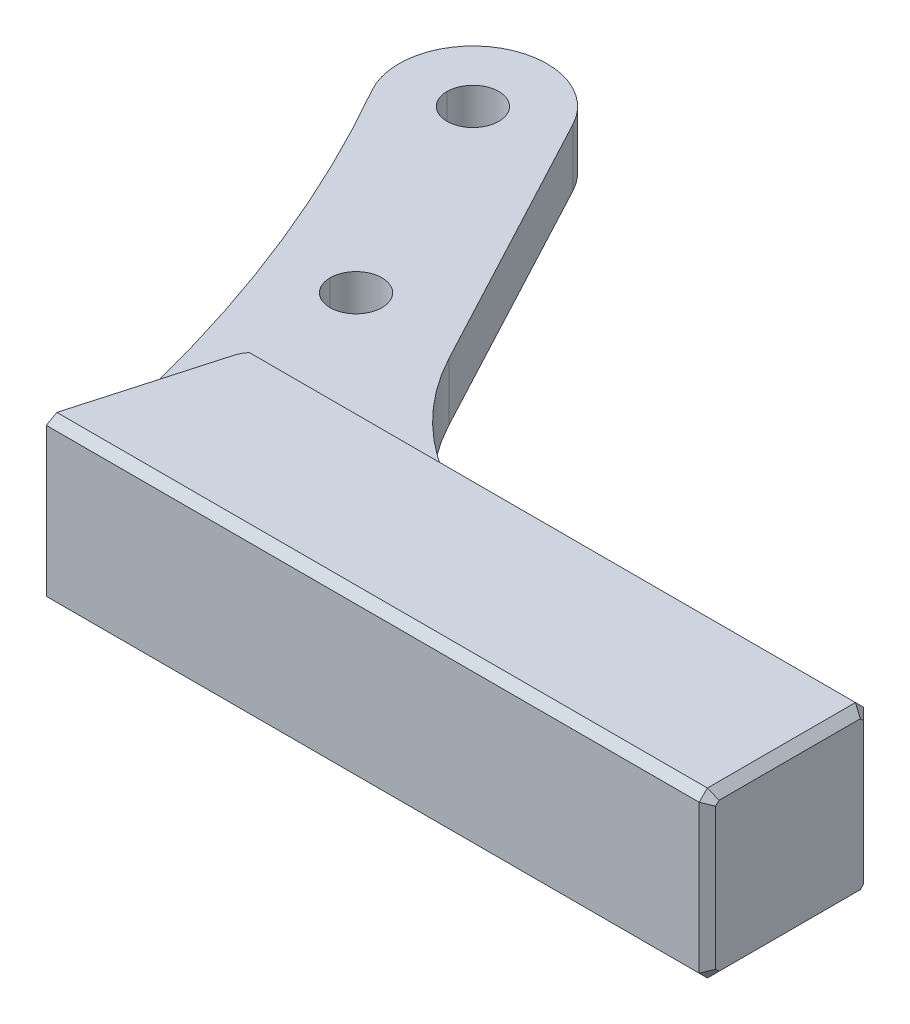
ISO-10303-21;
HEADER;
FILE_DESCRIPTION(('STEP AP214'),'2;1');
FILE_NAME('part.step','',(''),(''),'','','');
FILE_SCHEMA(('AUTOMOTIVE_DESIGN { 1 0 10303 214 1 1 1 1 }'));
ENDSEC;
DATA;
#1=APPLICATION_CONTEXT('core data for automotive mechanical design processes');
#2=APPLICATION_PROTOCOL_DEFINITION('international standard','automotive_design',2000,#1);
#3=PRODUCT_CONTEXT('',#1,'mechanical');
#4=PRODUCT('Part','Part','',(#3));
#5=PRODUCT_RELATED_PRODUCT_CATEGORY('part','',(#4));
#6=PRODUCT_DEFINITION_FORMATION('','',#4);
#7=PRODUCT_DEFINITION_CONTEXT('part definition',#1,'design');
#8=PRODUCT_DEFINITION('design','',#6,#7);
#9=PRODUCT_DEFINITION_SHAPE('','',#8);
#10=(LENGTH_UNIT() NAMED_UNIT(*) SI_UNIT(.MILLI.,.METRE.));
#11=(NAMED_UNIT(*) PLANE_ANGLE_UNIT() SI_UNIT($,.RADIAN.));
#12=(NAMED_UNIT(*) SI_UNIT($,.STERADIAN.) SOLID_ANGLE_UNIT());
#13=UNCERTAINTY_MEASURE_WITH_UNIT(LENGTH_MEASURE(1.E-05),#10,'distance_accuracy_value','');
#14=(GEOMETRIC_REPRESENTATION_CONTEXT(3) GLOBAL_UNCERTAINTY_ASSIGNED_CONTEXT((#13)) GLOBAL_UNIT_ASSIGNED_CONTEXT((#10,
#11,#12)) REPRESENTATION_CONTEXT('',''));
#15=CARTESIAN_POINT('',(0.,0.,0.));
#16=DIRECTION('',(0.,0.,1.));
#17=DIRECTION('',(1.,0.,0.));
#18=AXIS2_PLACEMENT_3D('',#15,#16,#17);
#19=CARTESIAN_POINT('',(1.66533453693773E-13,-3.49999999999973,0.));
#20=DIRECTION('',(0.,-1.,0.));
#21=DIRECTION('',(1.,0.,0.));
#22=AXIS2_PLACEMENT_3D('',#19,#20,#21);
#23=CYLINDRICAL_SURFACE('',#22,3.15);
#24=CARTESIAN_POINT('',(0.,3.49999999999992,0.));
#25=DIRECTION('',(0.,-1.,0.));
#26=DIRECTION('',(1.,0.,0.));
#27=AXIS2_PLACEMENT_3D('',#24,#25,#26);
#28=CIRCLE('',#27,3.15);
#29=CARTESIAN_POINT('',(-3.15000000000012,3.50000000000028,0.));
#30=VERTEX_POINT('',#29);
#31=CARTESIAN_POINT('',(3.14999999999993,3.50000000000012,0.));
#32=VERTEX_POINT('',#31);
#33=EDGE_CURVE('E39',#30,#32,#28,.T.);
#34=ORIENTED_EDGE('',*,*,#33,.F.);
#35=DIRECTION('',(0.,-1.,0.));
#36=VECTOR('',#35,1.);
#37=CARTESIAN_POINT('',(-3.15,-3.49999999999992,0.));
#38=LINE('',#37,#36);
#39=CARTESIAN_POINT('',(-3.15,-3.49999999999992,0.));
#40=VERTEX_POINT('',#39);
#41=EDGE_CURVE('E9',#30,#40,#38,.T.);
#42=ORIENTED_EDGE('',*,*,#41,.T.);
#43=CARTESIAN_POINT('',(1.66533453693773E-13,-3.49999999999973,0.));
#44=DIRECTION('',(0.,-1.,0.));
#45=DIRECTION('',(1.,0.,0.));
#46=AXIS2_PLACEMENT_3D('',#43,#44,#45);
#47=CIRCLE('',#46,3.15);
#48=CARTESIAN_POINT('',(3.14999999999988,-3.50000000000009,0.));
#49=VERTEX_POINT('',#48);
#50=EDGE_CURVE('E25',#40,#49,#47,.T.);
#51=ORIENTED_EDGE('',*,*,#50,.T.);
#52=DIRECTION('',(0.,-1.,0.));
#53=VECTOR('',#52,1.);
#54=CARTESIAN_POINT('',(3.14999999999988,-3.50000000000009,0.));
#55=LINE('',#54,#53);
#56=EDGE_CURVE('E207',#32,#49,#55,.T.);
#57=ORIENTED_EDGE('',*,*,#56,.F.);
#58=EDGE_LOOP('',(#34,#42,#51,#57));
#59=FACE_BOUND('',#58,.T.);
#60=ADVANCED_FACE('F14',(#59),#23,.F.);
#61=CARTESIAN_POINT('',(12.5070745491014,-3.49999999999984,26.717467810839));
#62=DIRECTION('',(0.,-1.,0.));
#63=DIRECTION('',(1.,0.,0.));
#64=AXIS2_PLACEMENT_3D('',#61,#62,#63);
#65=CYLINDRICAL_SURFACE('',#64,3.15);
#66=CARTESIAN_POINT('',(12.5070745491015,3.50000000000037,26.717467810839));
#67=DIRECTION('',(0.,-1.,0.));
#68=DIRECTION('',(1.,0.,0.));
#69=AXIS2_PLACEMENT_3D('',#66,#67,#68);
#70=CIRCLE('',#69,3.15);
#71=CARTESIAN_POINT('',(9.35707454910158,3.5000000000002,26.717467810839));
#72=VERTEX_POINT('',#71);
#73=CARTESIAN_POINT('',(15.6570745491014,3.5,26.717467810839));
#74=VERTEX_POINT('',#73);
#75=EDGE_CURVE('E386',#72,#74,#70,.T.);
#76=ORIENTED_EDGE('',*,*,#75,.F.);
#77=DIRECTION('',(0.,-1.,0.));
#78=VECTOR('',#77,1.);
#79=CARTESIAN_POINT('',(9.35707454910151,-3.5,26.717467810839));
#80=LINE('',#79,#78);
#81=CARTESIAN_POINT('',(9.35707454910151,-3.5,26.717467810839));
#82=VERTEX_POINT('',#81);
#83=EDGE_CURVE('E421',#72,#82,#80,.T.);
#84=ORIENTED_EDGE('',*,*,#83,.T.);
#85=CARTESIAN_POINT('',(12.5070745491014,-3.49999999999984,26.717467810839));
#86=DIRECTION('',(0.,-1.,0.));
#87=DIRECTION('',(1.,0.,0.));
#88=AXIS2_PLACEMENT_3D('',#85,#86,#87);
#89=CIRCLE('',#88,3.15);
#90=CARTESIAN_POINT('',(15.6570745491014,-3.49999999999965,26.717467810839));
#91=VERTEX_POINT('',#90);
#92=EDGE_CURVE('E106',#82,#91,#89,.T.);
#93=ORIENTED_EDGE('',*,*,#92,.T.);
#94=DIRECTION('',(0.,-1.,0.));
#95=VECTOR('',#94,1.);
#96=CARTESIAN_POINT('',(15.6570745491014,-3.49999999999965,26.717467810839));
#97=LINE('',#96,#95);
#98=EDGE_CURVE('E123',#74,#91,#97,.T.);
#99=ORIENTED_EDGE('',*,*,#98,.F.);
#100=EDGE_LOOP('',(#76,#84,#93,#99));
#101=FACE_BOUND('',#100,.T.);
#102=ADVANCED_FACE('F773',(#101),#65,.F.);
#103=CARTESIAN_POINT('',(94.8,10.,65.));
#104=DIRECTION('',(0.,1.,0.));
#105=DIRECTION('',(0.,0.,1.));
#106=AXIS2_PLACEMENT_3D('',#103,#104,#105);
#107=PLANE('',#106);
#108=DIRECTION('',(1.,0.,0.));
#109=VECTOR('',#108,1.);
#110=CARTESIAN_POINT('',(94.8,10.,64.));
#111=LINE('',#110,#109);
#112=CARTESIAN_POINT('',(13.4235630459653,10.0000000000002,64.));
#113=VERTEX_POINT('',#112);
#114=CARTESIAN_POINT('',(92.5,10.0000000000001,64.));
#115=VERTEX_POINT('',#114);
#116=EDGE_CURVE('E360',#113,#115,#111,.T.);
#117=ORIENTED_EDGE('',*,*,#116,.T.);
#118=DIRECTION('',(0.,0.,-1.));
#119=VECTOR('',#118,1.);
#120=CARTESIAN_POINT('',(92.5,10.0000000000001,65.));
#121=LINE('',#120,#119);
#122=CARTESIAN_POINT('',(92.5,10.0000000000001,46.));
#123=VERTEX_POINT('',#122);
#124=EDGE_CURVE('E364',#115,#123,#121,.T.);
#125=ORIENTED_EDGE('',*,*,#124,.T.);
#126=DIRECTION('',(-1.,0.,0.));
#127=VECTOR('',#126,1.);
#128=CARTESIAN_POINT('',(94.8,10.,46.));
#129=LINE('',#128,#127);
#130=CARTESIAN_POINT('',(18.8328166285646,10.,46.));
#131=VERTEX_POINT('',#130);
#132=EDGE_CURVE('E484',#123,#131,#129,.T.);
#133=ORIENTED_EDGE('',*,*,#132,.T.);
#134=CARTESIAN_POINT('',(21.0688846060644,10.,48.));
#135=DIRECTION('',(0.,1.,0.));
#136=DIRECTION('',(-1.,0.,0.));
#137=AXIS2_PLACEMENT_3D('',#134,#135,#136);
#138=CIRCLE('',#137,3.);
#139=CARTESIAN_POINT('',(18.1822297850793,10.,47.1831622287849));
#140=VERTEX_POINT('',#139);
#141=EDGE_CURVE('E405',#131,#140,#138,.T.);
#142=ORIENTED_EDGE('',*,*,#141,.T.);
#143=DIRECTION('',(0.272279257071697,0.,-0.962218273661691));
#144=VECTOR('',#143,1.);
#145=CARTESIAN_POINT('',(13.1405926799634,10.0000000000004,65.));
#146=LINE('',#145,#144);
#147=EDGE_CURVE('E359',#113,#140,#146,.T.);
#148=ORIENTED_EDGE('',*,*,#147,.F.);
#149=EDGE_LOOP('',(#117,#125,#133,#142,#148));
#150=FACE_BOUND('',#149,.T.);
#151=ADVANCED_FACE('F551',(#150),#107,.T.);
#152=CARTESIAN_POINT('',(94.8,10.,45.));
#153=DIRECTION('',(0.,0.,-1.));
#154=DIRECTION('',(-1.,0.,0.));
#155=AXIS2_PLACEMENT_3D('',#152,#153,#154);
#156=PLANE('',#155);
#157=DIRECTION('',(1.,0.,0.));
#158=VECTOR('',#157,1.);
#159=CARTESIAN_POINT('',(94.8,9.00000000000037,45.));
#160=LINE('',#159,#158);
#161=CARTESIAN_POINT('',(21.0688846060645,9.0000000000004,45.));
#162=VERTEX_POINT('',#161);
#163=CARTESIAN_POINT('',(92.5,9.,45.));
#164=VERTEX_POINT('',#163);
#165=EDGE_CURVE('E286',#162,#164,#160,.T.);
#166=ORIENTED_EDGE('',*,*,#165,.T.);
#167=DIRECTION('',(0.,-1.,0.));
#168=VECTOR('',#167,1.);
#169=CARTESIAN_POINT('',(92.5,10.0000000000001,45.));
#170=LINE('',#169,#168);
#171=CARTESIAN_POINT('',(92.5,-9.,45.));
#172=VERTEX_POINT('',#171);
#173=EDGE_CURVE('E283',#164,#172,#170,.T.);
#174=ORIENTED_EDGE('',*,*,#173,.T.);
#175=DIRECTION('',(-1.,0.,0.));
#176=VECTOR('',#175,1.);
#177=CARTESIAN_POINT('',(94.8,-8.99999999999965,45.));
#178=LINE('',#177,#176);
#179=CARTESIAN_POINT('',(21.0688846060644,-8.99999999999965,45.));
#180=VERTEX_POINT('',#179);
#181=EDGE_CURVE('E18',#172,#180,#178,.T.);
#182=ORIENTED_EDGE('',*,*,#181,.T.);
#183=DIRECTION('',(0.,1.,0.));
#184=VECTOR('',#183,1.);
#185=CARTESIAN_POINT('',(21.0688846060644,10.,45.));
#186=LINE('',#185,#184);
#187=CARTESIAN_POINT('',(21.0688846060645,-3.49999999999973,45.));
#188=VERTEX_POINT('',#187);
#189=EDGE_CURVE('E296',#180,#188,#186,.T.);
#190=ORIENTED_EDGE('',*,*,#189,.T.);
#191=DIRECTION('',(-1.,0.,0.));
#192=VECTOR('',#191,1.);
#193=CARTESIAN_POINT('',(94.8,-3.49999999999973,45.));
#194=LINE('',#193,#192);
#195=CARTESIAN_POINT('',(53.3475946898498,-3.5,45.));
#196=VERTEX_POINT('',#195);
#197=EDGE_CURVE('E391',#196,#188,#194,.T.);
#198=ORIENTED_EDGE('',*,*,#197,.F.);
#199=DIRECTION('',(0.,-1.,0.));
#200=VECTOR('',#199,1.);
#201=CARTESIAN_POINT('',(53.3475946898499,3.50000000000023,45.));
#202=LINE('',#201,#200);
#203=CARTESIAN_POINT('',(53.3475946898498,3.50000000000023,45.));
#204=VERTEX_POINT('',#203);
#205=EDGE_CURVE('E408',#204,#196,#202,.T.);
#206=ORIENTED_EDGE('',*,*,#205,.F.);
#207=DIRECTION('',(-1.,0.,0.));
#208=VECTOR('',#207,1.);
#209=CARTESIAN_POINT('',(94.8,3.50000000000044,45.));
#210=LINE('',#209,#208);
#211=CARTESIAN_POINT('',(21.0688846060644,3.5,45.));
#212=VERTEX_POINT('',#211);
#213=EDGE_CURVE('E292',#204,#212,#210,.T.);
#214=ORIENTED_EDGE('',*,*,#213,.T.);
#215=DIRECTION('',(0.,1.,0.));
#216=VECTOR('',#215,1.);
#217=CARTESIAN_POINT('',(21.0688846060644,10.,45.));
#218=LINE('',#217,#216);
#219=EDGE_CURVE('E297',#212,#162,#218,.T.);
#220=ORIENTED_EDGE('',*,*,#219,.T.);
#221=EDGE_LOOP('',(#166,#174,#182,#190,#198,#206,#214,#220));
#222=FACE_BOUND('',#221,.T.);
#223=ADVANCED_FACE('F539',(#222),#156,.T.);
#224=CARTESIAN_POINT('',(94.8,-9.99999999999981,65.));
#225=DIRECTION('',(0.,0.,1.));
#226=DIRECTION('',(0.,1.,0.));
#227=AXIS2_PLACEMENT_3D('',#224,#225,#226);
#228=PLANE('',#227);
#229=DIRECTION('',(1.,0.,0.));
#230=VECTOR('',#229,1.);
#231=CARTESIAN_POINT('',(94.8,-8.99999999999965,65.));
#232=LINE('',#231,#230);
#233=CARTESIAN_POINT('',(13.1405926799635,-8.99999999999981,65.));
#234=VERTEX_POINT('',#233);
#235=CARTESIAN_POINT('',(92.5,-9.,65.));
#236=VERTEX_POINT('',#235);
#237=EDGE_CURVE('E264',#234,#236,#232,.T.);
#238=ORIENTED_EDGE('',*,*,#237,.T.);
#239=DIRECTION('',(0.,1.,0.));
#240=VECTOR('',#239,1.);
#241=CARTESIAN_POINT('',(92.5,-9.9999999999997,65.));
#242=LINE('',#241,#240);
#243=CARTESIAN_POINT('',(92.5,9.,65.));
#244=VERTEX_POINT('',#243);
#245=EDGE_CURVE('E309',#236,#244,#242,.T.);
#246=ORIENTED_EDGE('',*,*,#245,.T.);
#247=DIRECTION('',(-1.,0.,0.));
#248=VECTOR('',#247,1.);
#249=CARTESIAN_POINT('',(94.8,9.00000000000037,65.));
#250=LINE('',#249,#248);
#251=CARTESIAN_POINT('',(13.1405926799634,9.0000000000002,65.));
#252=VERTEX_POINT('',#251);
#253=EDGE_CURVE('E313',#244,#252,#250,.T.);
#254=ORIENTED_EDGE('',*,*,#253,.T.);
#255=DIRECTION('',(0.,-1.,0.));
#256=VECTOR('',#255,1.);
#257=CARTESIAN_POINT('',(13.1405926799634,10.0000000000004,65.));
#258=LINE('',#257,#256);
#259=CARTESIAN_POINT('',(13.1405926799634,3.50000000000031,65.));
#260=VERTEX_POINT('',#259);
#261=EDGE_CURVE('E373',#252,#260,#258,.T.);
#262=ORIENTED_EDGE('',*,*,#261,.T.);
#263=DIRECTION('',(0.,-1.,0.));
#264=VECTOR('',#263,1.);
#265=CARTESIAN_POINT('',(13.1405926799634,3.50000000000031,65.));
#266=LINE('',#265,#264);
#267=CARTESIAN_POINT('',(13.1405926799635,-3.49999999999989,65.));
#268=VERTEX_POINT('',#267);
#269=EDGE_CURVE('E369',#260,#268,#266,.T.);
#270=ORIENTED_EDGE('',*,*,#269,.T.);
#271=DIRECTION('',(0.,-1.,0.));
#272=VECTOR('',#271,1.);
#273=CARTESIAN_POINT('',(13.1405926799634,10.0000000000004,65.));
#274=LINE('',#273,#272);
#275=EDGE_CURVE('E374',#268,#234,#274,.T.);
#276=ORIENTED_EDGE('',*,*,#275,.T.);
#277=EDGE_LOOP('',(#238,#246,#254,#262,#270,#276));
#278=FACE_BOUND('',#277,.T.);
#279=ADVANCED_FACE('F742',(#278),#228,.T.);
#280=CARTESIAN_POINT('',(94.8,-9.99999999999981,45.));
#281=DIRECTION('',(0.,-1.,0.));
#282=DIRECTION('',(0.,0.,1.));
#283=AXIS2_PLACEMENT_3D('',#280,#281,#282);
#284=PLANE('',#283);
#285=DIRECTION('',(1.,0.,0.));
#286=VECTOR('',#285,1.);
#287=CARTESIAN_POINT('',(94.8,-9.99999999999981,46.));
#288=LINE('',#287,#286);
#289=CARTESIAN_POINT('',(18.8328166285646,-9.99999999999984,46.));
#290=VERTEX_POINT('',#289);
#291=CARTESIAN_POINT('',(92.5,-9.9999999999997,46.));
#292=VERTEX_POINT('',#291);
#293=EDGE_CURVE('E412',#290,#292,#288,.T.);
#294=ORIENTED_EDGE('',*,*,#293,.T.);
#295=DIRECTION('',(0.,0.,1.));
#296=VECTOR('',#295,1.);
#297=CARTESIAN_POINT('',(92.5,-9.9999999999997,45.));
#298=LINE('',#297,#296);
#299=CARTESIAN_POINT('',(92.5,-9.9999999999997,64.));
#300=VERTEX_POINT('',#299);
#301=EDGE_CURVE('E256',#292,#300,#298,.T.);
#302=ORIENTED_EDGE('',*,*,#301,.T.);
#303=DIRECTION('',(-1.,0.,0.));
#304=VECTOR('',#303,1.);
#305=CARTESIAN_POINT('',(94.8,-9.99999999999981,64.));
#306=LINE('',#305,#304);
#307=CARTESIAN_POINT('',(13.4235630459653,-9.99999999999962,64.));
#308=VERTEX_POINT('',#307);
#309=EDGE_CURVE('E248',#300,#308,#306,.T.);
#310=ORIENTED_EDGE('',*,*,#309,.T.);
#311=DIRECTION('',(0.272279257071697,0.,-0.962218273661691));
#312=VECTOR('',#311,1.);
#313=CARTESIAN_POINT('',(13.1405926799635,-10.,65.));
#314=LINE('',#313,#312);
#315=CARTESIAN_POINT('',(18.1822297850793,-9.99999999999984,47.1831622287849));
#316=VERTEX_POINT('',#315);
#317=EDGE_CURVE('E237',#308,#316,#314,.T.);
#318=ORIENTED_EDGE('',*,*,#317,.T.);
#319=CARTESIAN_POINT('',(21.0688846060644,-9.99999999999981,48.));
#320=DIRECTION('',(0.,-1.,0.));
#321=DIRECTION('',(1.,0.,0.));
#322=AXIS2_PLACEMENT_3D('',#319,#320,#321);
#323=CIRCLE('',#322,3.);
#324=EDGE_CURVE('E249',#316,#290,#323,.T.);
#325=ORIENTED_EDGE('',*,*,#324,.T.);
#326=EDGE_LOOP('',(#294,#302,#310,#318,#325));
#327=FACE_BOUND('',#326,.T.);
#328=ADVANCED_FACE('F254',(#327),#284,.T.);
#329=CARTESIAN_POINT('',(94.8,-8.99999999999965,45.));
#330=DIRECTION('',(0.,0.70710678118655,0.707106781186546));
#331=DIRECTION('',(-1.,0.,0.));
#332=AXIS2_PLACEMENT_3D('',#329,#330,#331);
#333=PLANE('',#332);
#334=ORIENTED_EDGE('',*,*,#181,.F.);
#335=DIRECTION('',(0.,-0.707106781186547,0.707106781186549));
#336=VECTOR('',#335,1.);
#337=CARTESIAN_POINT('',(92.5,-9.,45.));
#338=LINE('',#337,#336);
#339=EDGE_CURVE('E305',#172,#292,#338,.T.);
#340=ORIENTED_EDGE('',*,*,#339,.T.);
#341=ORIENTED_EDGE('',*,*,#293,.F.);
#342=CARTESIAN_POINT('',(18.8328166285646,-9.99999999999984,46.));
#343=CARTESIAN_POINT('',(19.4107155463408,-9.35388936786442,45.3538893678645));
#344=CARTESIAN_POINT('',(20.2020362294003,-8.99999999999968,44.9999999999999));
#345=CARTESIAN_POINT('',(21.0688846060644,-8.99999999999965,45.));
#346=(BOUNDED_CURVE() B_SPLINE_CURVE(3,(#342,#343,#344,#345),.UNSPECIFIED.,.F.,
.F.) B_SPLINE_CURVE_WITH_KNOTS((4,4),(2.30052398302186,3.1415926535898),
.UNSPECIFIED.) CURVE() GEOMETRIC_REPRESENTATION_ITEM() RATIONAL_B_SPLINE_CURVE((1.,
0.941913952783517,0.941913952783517,1.)) REPRESENTATION_ITEM(''));
#347=EDGE_CURVE('E308',#290,#180,#346,.T.);
#348=ORIENTED_EDGE('',*,*,#347,.T.);
#349=EDGE_LOOP('',(#334,#340,#341,#348));
#350=FACE_BOUND('',#349,.T.);
#351=ADVANCED_FACE('F768',(#350),#333,.F.);
#352=CARTESIAN_POINT('',(94.8,-9.99999999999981,64.));
#353=DIRECTION('',(0.,0.707106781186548,-0.707106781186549));
#354=DIRECTION('',(-1.,0.,0.));
#355=AXIS2_PLACEMENT_3D('',#352,#353,#354);
#356=PLANE('',#355);
#357=ORIENTED_EDGE('',*,*,#309,.F.);
#358=DIRECTION('',(0.,0.70710678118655,0.707106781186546));
#359=VECTOR('',#358,1.);
#360=CARTESIAN_POINT('',(92.5,-9.9999999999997,64.));
#361=LINE('',#360,#359);
#362=EDGE_CURVE('E385',#300,#236,#361,.T.);
#363=ORIENTED_EDGE('',*,*,#362,.T.);
#364=ORIENTED_EDGE('',*,*,#237,.F.);
#365=DIRECTION('',(-0.1962012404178,0.693363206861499,0.693363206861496));
#366=VECTOR('',#365,1.);
#367=CARTESIAN_POINT('',(10.5558569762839,0.134298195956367,74.1342981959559));
#368=LINE('',#367,#366);
#369=EDGE_CURVE('E242',#308,#234,#368,.T.);
#370=ORIENTED_EDGE('',*,*,#369,.F.);
#371=EDGE_LOOP('',(#357,#363,#364,#370));
#372=FACE_BOUND('',#371,.T.);
#373=ADVANCED_FACE('F262',(#372),#356,.F.);
#374=CARTESIAN_POINT('',(94.8,10.,46.));
#375=DIRECTION('',(0.,-0.707106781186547,0.707106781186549));
#376=DIRECTION('',(1.,0.,0.));
#377=AXIS2_PLACEMENT_3D('',#374,#375,#376);
#378=PLANE('',#377);
#379=ORIENTED_EDGE('',*,*,#132,.F.);
#380=DIRECTION('',(0.,-0.70710678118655,-0.707106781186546));
#381=VECTOR('',#380,1.);
#382=CARTESIAN_POINT('',(92.5,10.0000000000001,46.));
#383=LINE('',#382,#381);
#384=EDGE_CURVE('E351',#123,#164,#383,.T.);
#385=ORIENTED_EDGE('',*,*,#384,.T.);
#386=ORIENTED_EDGE('',*,*,#165,.F.);
#387=CARTESIAN_POINT('',(21.0688846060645,9.0000000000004,45.));
#388=CARTESIAN_POINT('',(20.2020362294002,9.00000000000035,45.));
#389=CARTESIAN_POINT('',(19.4107155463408,9.35388936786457,45.3538893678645));
#390=CARTESIAN_POINT('',(18.8328166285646,10.,46.));
#391=(BOUNDED_CURVE() B_SPLINE_CURVE(3,(#387,#388,#389,#390),.UNSPECIFIED.,.F.,
.F.) B_SPLINE_CURVE_WITH_KNOTS((4,4),(0.,0.841068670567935),
.UNSPECIFIED.) CURVE() GEOMETRIC_REPRESENTATION_ITEM() RATIONAL_B_SPLINE_CURVE((1.,
0.941913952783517,0.941913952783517,1.)) REPRESENTATION_ITEM(''));
#392=EDGE_CURVE('E345',#162,#131,#391,.T.);
#393=ORIENTED_EDGE('',*,*,#392,.T.);
#394=EDGE_LOOP('',(#379,#385,#386,#393));
#395=FACE_BOUND('',#394,.T.);
#396=ADVANCED_FACE('F544',(#395),#378,.F.);
#397=CARTESIAN_POINT('',(94.8,10.,64.));
#398=DIRECTION('',(0.,-0.707106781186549,-0.707106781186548));
#399=DIRECTION('',(0.,-0.707106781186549,0.707106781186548));
#400=AXIS2_PLACEMENT_3D('',#397,#398,#399);
#401=PLANE('',#400);
#402=ORIENTED_EDGE('',*,*,#253,.F.);
#403=DIRECTION('',(0.,0.707106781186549,-0.707106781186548));
#404=VECTOR('',#403,1.);
#405=CARTESIAN_POINT('',(92.5,10.0000000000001,64.));
#406=LINE('',#405,#404);
#407=EDGE_CURVE('E352',#244,#115,#406,.T.);
#408=ORIENTED_EDGE('',*,*,#407,.T.);
#409=ORIENTED_EDGE('',*,*,#116,.F.);
#410=DIRECTION('',(0.1962012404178,0.693363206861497,-0.693363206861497));
#411=VECTOR('',#410,1.);
#412=CARTESIAN_POINT('',(13.2766314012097,9.48075253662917,64.5192474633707));
#413=LINE('',#412,#411);
#414=EDGE_CURVE('E273',#252,#113,#413,.T.);
#415=ORIENTED_EDGE('',*,*,#414,.F.);
#416=EDGE_LOOP('',(#402,#408,#409,#415));
#417=FACE_BOUND('',#416,.T.);
#418=ADVANCED_FACE('F820',(#417),#401,.F.);
#419=CARTESIAN_POINT('',(13.1405926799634,10.0000000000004,65.));
#420=DIRECTION('',(-0.962218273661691,0.,-0.272279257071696));
#421=DIRECTION('',(0.272279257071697,0.,-0.962218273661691));
#422=AXIS2_PLACEMENT_3D('',#419,#420,#421);
#423=PLANE('',#422);
#424=ORIENTED_EDGE('',*,*,#147,.T.);
#425=DIRECTION('',(0.,-1.,0.));
#426=VECTOR('',#425,1.);
#427=CARTESIAN_POINT('',(18.1822297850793,10.,47.1831622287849));
#428=LINE('',#427,#426);
#429=CARTESIAN_POINT('',(18.1822297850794,3.49999999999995,47.1831622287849));
#430=VERTEX_POINT('',#429);
#431=EDGE_CURVE('E365',#140,#430,#428,.T.);
#432=ORIENTED_EDGE('',*,*,#431,.T.);
#433=DIRECTION('',(-0.272279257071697,0.,0.962218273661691));
#434=VECTOR('',#433,1.);
#435=CARTESIAN_POINT('',(13.1405926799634,3.50000000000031,65.));
#436=LINE('',#435,#434);
#437=EDGE_CURVE('E321',#430,#260,#436,.T.);
#438=ORIENTED_EDGE('',*,*,#437,.T.);
#439=ORIENTED_EDGE('',*,*,#261,.F.);
#440=ORIENTED_EDGE('',*,*,#414,.T.);
#441=EDGE_LOOP('',(#424,#432,#438,#439,#440));
#442=FACE_BOUND('',#441,.T.);
#443=ADVANCED_FACE('F816',(#442),#423,.T.);
#444=CARTESIAN_POINT('',(13.1405926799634,10.0000000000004,65.));
#445=DIRECTION('',(-0.962218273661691,0.,-0.272279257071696));
#446=DIRECTION('',(0.272279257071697,0.,-0.962218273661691));
#447=AXIS2_PLACEMENT_3D('',#444,#445,#446);
#448=PLANE('',#447);
#449=DIRECTION('',(-0.272279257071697,0.,0.962218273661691));
#450=VECTOR('',#449,1.);
#451=CARTESIAN_POINT('',(13.1405926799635,-3.49999999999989,65.));
#452=LINE('',#451,#450);
#453=CARTESIAN_POINT('',(18.1822297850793,-3.49999999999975,47.1831622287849));
#454=VERTEX_POINT('',#453);
#455=EDGE_CURVE('E431',#454,#268,#452,.T.);
#456=ORIENTED_EDGE('',*,*,#455,.F.);
#457=DIRECTION('',(0.,-1.,0.));
#458=VECTOR('',#457,1.);
#459=CARTESIAN_POINT('',(18.1822297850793,10.,47.1831622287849));
#460=LINE('',#459,#458);
#461=EDGE_CURVE('E244',#454,#316,#460,.T.);
#462=ORIENTED_EDGE('',*,*,#461,.T.);
#463=ORIENTED_EDGE('',*,*,#317,.F.);
#464=ORIENTED_EDGE('',*,*,#369,.T.);
#465=ORIENTED_EDGE('',*,*,#275,.F.);
#466=EDGE_LOOP('',(#456,#462,#463,#464,#465));
#467=FACE_BOUND('',#466,.T.);
#468=ADVANCED_FACE('F239',(#467),#448,.T.);
#469=CARTESIAN_POINT('',(-158.665787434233,3.50000000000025,90.5784626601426));
#470=DIRECTION('',(0.,-1.,0.));
#471=DIRECTION('',(1.,0.,0.));
#472=AXIS2_PLACEMENT_3D('',#469,#470,#471);
#473=CYLINDRICAL_SURFACE('',#472,173.7);
#474=DIRECTION('',(0.,-1.,0.));
#475=VECTOR('',#474,1.);
#476=CARTESIAN_POINT('',(-7.81604864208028,3.50000000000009,4.4619932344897));
#477=LINE('',#476,#475);
#478=CARTESIAN_POINT('',(-7.81604864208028,3.50000000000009,4.4619932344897));
#479=VERTEX_POINT('',#478);
#480=CARTESIAN_POINT('',(-7.81604864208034,-3.50000000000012,4.4619932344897));
#481=VERTEX_POINT('',#480);
#482=EDGE_CURVE('E266',#479,#481,#477,.T.);
#483=ORIENTED_EDGE('',*,*,#482,.T.);
#484=CARTESIAN_POINT('',(-158.665787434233,-3.49999999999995,90.5784626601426));
#485=DIRECTION('',(0.,-1.,0.));
#486=DIRECTION('',(1.,0.,0.));
#487=AXIS2_PLACEMENT_3D('',#484,#485,#486);
#488=CIRCLE('',#487,173.7);
#489=EDGE_CURVE('E277',#481,#268,#488,.T.);
#490=ORIENTED_EDGE('',*,*,#489,.T.);
#491=ORIENTED_EDGE('',*,*,#269,.F.);
#492=CARTESIAN_POINT('',(-158.665787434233,3.50000000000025,90.5784626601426));
#493=DIRECTION('',(0.,-1.,0.));
#494=DIRECTION('',(1.,0.,0.));
#495=AXIS2_PLACEMENT_3D('',#492,#493,#494);
#496=CIRCLE('',#495,173.7);
#497=EDGE_CURVE('E439',#479,#260,#496,.T.);
#498=ORIENTED_EDGE('',*,*,#497,.F.);
#499=EDGE_LOOP('',(#483,#490,#491,#498));
#500=FACE_BOUND('',#499,.T.);
#501=ADVANCED_FACE('F829',(#500),#473,.F.);
#502=CARTESIAN_POINT('',(53.3475946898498,3.50000000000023,13.));
#503=DIRECTION('',(0.,-1.,0.));
#504=DIRECTION('',(1.,0.,0.));
#505=AXIS2_PLACEMENT_3D('',#502,#503,#504);
#506=CYLINDRICAL_SURFACE('',#505,32.);
#507=ORIENTED_EDGE('',*,*,#205,.T.);
#508=CARTESIAN_POINT('',(53.3475946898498,-3.5,13.));
#509=DIRECTION('',(0.,-1.,0.));
#510=DIRECTION('',(-1.,0.,0.));
#511=AXIS2_PLACEMENT_3D('',#508,#509,#510);
#512=CIRCLE('',#511,32.);
#513=CARTESIAN_POINT('',(25.093271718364,-3.49999999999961,28.0230900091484));
#514=VERTEX_POINT('',#513);
#515=EDGE_CURVE('E290',#196,#514,#512,.T.);
#516=ORIENTED_EDGE('',*,*,#515,.T.);
#517=DIRECTION('',(0.,-1.,0.));
#518=VECTOR('',#517,1.);
#519=CARTESIAN_POINT('',(25.093271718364,3.50000000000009,28.0230900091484));
#520=LINE('',#519,#518);
#521=CARTESIAN_POINT('',(25.093271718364,3.50000000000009,28.0230900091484));
#522=VERTEX_POINT('',#521);
#523=EDGE_CURVE('E287',#522,#514,#520,.T.);
#524=ORIENTED_EDGE('',*,*,#523,.F.);
#525=CARTESIAN_POINT('',(53.3475946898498,3.50000000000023,13.));
#526=DIRECTION('',(0.,-1.,0.));
#527=DIRECTION('',(-1.,0.,0.));
#528=AXIS2_PLACEMENT_3D('',#525,#526,#527);
#529=CIRCLE('',#528,32.);
#530=EDGE_CURVE('E341',#204,#522,#529,.T.);
#531=ORIENTED_EDGE('',*,*,#530,.F.);
#532=EDGE_LOOP('',(#507,#516,#524,#531));
#533=FACE_BOUND('',#532,.T.);
#534=ADVANCED_FACE('F838',(#533),#506,.F.);
#535=CARTESIAN_POINT('',(25.093271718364,3.50000000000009,28.0230900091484));
#536=DIRECTION('',(-0.882947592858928,0.,0.469471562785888));
#537=DIRECTION('',(0.,-1.,0.));
#538=AXIS2_PLACEMENT_3D('',#535,#536,#537);
#539=PLANE('',#538);
#540=ORIENTED_EDGE('',*,*,#523,.T.);
#541=DIRECTION('',(-0.469471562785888,0.,-0.882947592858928));
#542=VECTOR('',#541,1.);
#543=CARTESIAN_POINT('',(25.093271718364,-3.49999999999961,28.0230900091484));
#544=LINE('',#543,#542);
#545=CARTESIAN_POINT('',(7.94652833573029,-3.49999999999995,-4.22524406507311));
#546=VERTEX_POINT('',#545);
#547=EDGE_CURVE('E291',#514,#546,#544,.T.);
#548=ORIENTED_EDGE('',*,*,#547,.T.);
#549=DIRECTION('',(0.,-1.,0.));
#550=VECTOR('',#549,1.);
#551=CARTESIAN_POINT('',(7.94652833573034,3.50000000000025,-4.22524406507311));
#552=LINE('',#551,#550);
#553=CARTESIAN_POINT('',(7.94652833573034,3.50000000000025,-4.22524406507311));
#554=VERTEX_POINT('',#553);
#555=EDGE_CURVE('E314',#554,#546,#552,.T.);
#556=ORIENTED_EDGE('',*,*,#555,.F.);
#557=DIRECTION('',(-0.469471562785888,0.,-0.882947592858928));
#558=VECTOR('',#557,1.);
#559=CARTESIAN_POINT('',(25.093271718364,3.50000000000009,28.0230900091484));
#560=LINE('',#559,#558);
#561=EDGE_CURVE('E344',#522,#554,#560,.T.);
#562=ORIENTED_EDGE('',*,*,#561,.F.);
#563=EDGE_LOOP('',(#540,#548,#556,#562));
#564=FACE_BOUND('',#563,.T.);
#565=ADVANCED_FACE('F834',(#564),#539,.F.);
#566=CARTESIAN_POINT('',(0.,3.49999999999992,0.));
#567=DIRECTION('',(0.,-1.,0.));
#568=DIRECTION('',(1.,0.,0.));
#569=AXIS2_PLACEMENT_3D('',#566,#567,#568);
#570=CYLINDRICAL_SURFACE('',#569,9.);
#571=ORIENTED_EDGE('',*,*,#555,.T.);
#572=CARTESIAN_POINT('',(1.66533453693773E-13,-3.49999999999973,0.));
#573=DIRECTION('',(0.,1.,0.));
#574=DIRECTION('',(-1.,0.,0.));
#575=AXIS2_PLACEMENT_3D('',#572,#573,#574);
#576=CIRCLE('',#575,9.);
#577=EDGE_CURVE('E317',#546,#481,#576,.T.);
#578=ORIENTED_EDGE('',*,*,#577,.T.);
#579=ORIENTED_EDGE('',*,*,#482,.F.);
#580=CARTESIAN_POINT('',(0.,3.49999999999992,0.));
#581=DIRECTION('',(0.,1.,0.));
#582=DIRECTION('',(-1.,0.,0.));
#583=AXIS2_PLACEMENT_3D('',#580,#581,#582);
#584=CIRCLE('',#583,9.);
#585=EDGE_CURVE('E443',#554,#479,#584,.T.);
#586=ORIENTED_EDGE('',*,*,#585,.F.);
#587=EDGE_LOOP('',(#571,#578,#579,#586));
#588=FACE_BOUND('',#587,.T.);
#589=ADVANCED_FACE('F787',(#588),#570,.T.);
#590=CARTESIAN_POINT('',(-158.665787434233,3.50000000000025,90.5784626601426));
#591=DIRECTION('',(0.,-1.,0.));
#592=DIRECTION('',(0.,0.,1.));
#593=AXIS2_PLACEMENT_3D('',#590,#591,#592);
#594=PLANE('',#593);
#595=ORIENTED_EDGE('',*,*,#213,.F.);
#596=ORIENTED_EDGE('',*,*,#530,.T.);
#597=ORIENTED_EDGE('',*,*,#561,.T.);
#598=ORIENTED_EDGE('',*,*,#585,.T.);
#599=ORIENTED_EDGE('',*,*,#497,.T.);
#600=ORIENTED_EDGE('',*,*,#437,.F.);
#601=CARTESIAN_POINT('',(21.0688846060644,3.5,48.));
#602=DIRECTION('',(0.,-1.,0.));
#603=DIRECTION('',(1.,0.,0.));
#604=AXIS2_PLACEMENT_3D('',#601,#602,#603);
#605=CIRCLE('',#604,3.);
#606=EDGE_CURVE('E444',#430,#212,#605,.T.);
#607=ORIENTED_EDGE('',*,*,#606,.T.);
#608=EDGE_LOOP('',(#595,#596,#597,#598,#599,#600,#607));
#609=FACE_BOUND('',#608,.T.);
#610=CARTESIAN_POINT('',(0.,3.49999999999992,0.));
#611=DIRECTION('',(0.,-1.,0.));
#612=DIRECTION('',(1.,0.,0.));
#613=AXIS2_PLACEMENT_3D('',#610,#611,#612);
#614=CIRCLE('',#613,3.15);
#615=EDGE_CURVE('E437',#32,#30,#614,.T.);
#616=ORIENTED_EDGE('',*,*,#615,.T.);
#617=ORIENTED_EDGE('',*,*,#33,.T.);
#618=EDGE_LOOP('',(#616,#617));
#619=FACE_BOUND('',#618,.T.);
#620=CARTESIAN_POINT('',(12.5070745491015,3.50000000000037,26.717467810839));
#621=DIRECTION('',(0.,-1.,0.));
#622=DIRECTION('',(1.,0.,0.));
#623=AXIS2_PLACEMENT_3D('',#620,#621,#622);
#624=CIRCLE('',#623,3.15);
#625=EDGE_CURVE('E390',#74,#72,#624,.T.);
#626=ORIENTED_EDGE('',*,*,#625,.T.);
#627=ORIENTED_EDGE('',*,*,#75,.T.);
#628=EDGE_LOOP('',(#626,#627));
#629=FACE_BOUND('',#628,.T.);
#630=ADVANCED_FACE('F782',(#609,#619,#629),#594,.F.);
#631=CARTESIAN_POINT('',(-158.665787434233,-3.49999999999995,90.5784626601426));
#632=DIRECTION('',(0.,-1.,0.));
#633=DIRECTION('',(0.,0.,1.));
#634=AXIS2_PLACEMENT_3D('',#631,#632,#633);
#635=PLANE('',#634);
#636=ORIENTED_EDGE('',*,*,#515,.F.);
#637=ORIENTED_EDGE('',*,*,#197,.T.);
#638=CARTESIAN_POINT('',(21.0688846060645,-3.49999999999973,48.));
#639=DIRECTION('',(0.,1.,0.));
#640=DIRECTION('',(1.,0.,0.));
#641=AXIS2_PLACEMENT_3D('',#638,#639,#640);
#642=CIRCLE('',#641,3.);
#643=EDGE_CURVE('E492',#188,#454,#642,.T.);
#644=ORIENTED_EDGE('',*,*,#643,.T.);
#645=ORIENTED_EDGE('',*,*,#455,.T.);
#646=ORIENTED_EDGE('',*,*,#489,.F.);
#647=ORIENTED_EDGE('',*,*,#577,.F.);
#648=ORIENTED_EDGE('',*,*,#547,.F.);
#649=EDGE_LOOP('',(#636,#637,#644,#645,#646,#647,#648));
#650=FACE_BOUND('',#649,.T.);
#651=CARTESIAN_POINT('',(1.66533453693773E-13,-3.49999999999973,0.));
#652=DIRECTION('',(0.,-1.,0.));
#653=DIRECTION('',(1.,0.,0.));
#654=AXIS2_PLACEMENT_3D('',#651,#652,#653);
#655=CIRCLE('',#654,3.15);
#656=EDGE_CURVE('E298',#49,#40,#655,.T.);
#657=ORIENTED_EDGE('',*,*,#656,.F.);
#658=ORIENTED_EDGE('',*,*,#50,.F.);
#659=EDGE_LOOP('',(#657,#658));
#660=FACE_BOUND('',#659,.T.);
#661=CARTESIAN_POINT('',(12.5070745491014,-3.49999999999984,26.717467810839));
#662=DIRECTION('',(0.,-1.,0.));
#663=DIRECTION('',(1.,0.,0.));
#664=AXIS2_PLACEMENT_3D('',#661,#662,#663);
#665=CIRCLE('',#664,3.15);
#666=EDGE_CURVE('E394',#91,#82,#665,.T.);
#667=ORIENTED_EDGE('',*,*,#666,.F.);
#668=ORIENTED_EDGE('',*,*,#92,.F.);
#669=EDGE_LOOP('',(#667,#668));
#670=FACE_BOUND('',#669,.T.);
#671=ADVANCED_FACE('F786',(#650,#660,#670),#635,.T.);
#672=CARTESIAN_POINT('',(12.5070745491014,-3.49999999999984,26.717467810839));
#673=DIRECTION('',(0.,-1.,0.));
#674=DIRECTION('',(1.,0.,0.));
#675=AXIS2_PLACEMENT_3D('',#672,#673,#674);
#676=CYLINDRICAL_SURFACE('',#675,3.15);
#677=ORIENTED_EDGE('',*,*,#83,.F.);
#678=ORIENTED_EDGE('',*,*,#625,.F.);
#679=ORIENTED_EDGE('',*,*,#98,.T.);
#680=ORIENTED_EDGE('',*,*,#666,.T.);
#681=EDGE_LOOP('',(#677,#678,#679,#680));
#682=FACE_BOUND('',#681,.T.);
#683=ADVANCED_FACE('F16',(#682),#676,.F.);
#684=CARTESIAN_POINT('',(1.66533453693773E-13,-3.49999999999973,0.));
#685=DIRECTION('',(0.,-1.,0.));
#686=DIRECTION('',(1.,0.,0.));
#687=AXIS2_PLACEMENT_3D('',#684,#685,#686);
#688=CYLINDRICAL_SURFACE('',#687,3.15);
#689=ORIENTED_EDGE('',*,*,#41,.F.);
#690=ORIENTED_EDGE('',*,*,#615,.F.);
#691=ORIENTED_EDGE('',*,*,#56,.T.);
#692=ORIENTED_EDGE('',*,*,#656,.T.);
#693=EDGE_LOOP('',(#689,#690,#691,#692));
#694=FACE_BOUND('',#693,.T.);
#695=ADVANCED_FACE('F853',(#694),#688,.F.);
#696=CARTESIAN_POINT('',(21.0688846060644,10.,48.));
#697=DIRECTION('',(0.,-1.,0.));
#698=DIRECTION('',(1.,0.,0.));
#699=AXIS2_PLACEMENT_3D('',#696,#697,#698);
#700=CYLINDRICAL_SURFACE('',#699,3.);
#701=ORIENTED_EDGE('',*,*,#643,.F.);
#702=ORIENTED_EDGE('',*,*,#189,.F.);
#703=ORIENTED_EDGE('',*,*,#347,.F.);
#704=ORIENTED_EDGE('',*,*,#324,.F.);
#705=ORIENTED_EDGE('',*,*,#461,.F.);
#706=EDGE_LOOP('',(#701,#702,#703,#704,#705));
#707=FACE_BOUND('',#706,.T.);
#708=ADVANCED_FACE('F857',(#707),#700,.T.);
#709=CARTESIAN_POINT('',(21.0688846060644,10.,48.));
#710=DIRECTION('',(0.,-1.,0.));
#711=DIRECTION('',(1.,0.,0.));
#712=AXIS2_PLACEMENT_3D('',#709,#710,#711);
#713=CYLINDRICAL_SURFACE('',#712,3.);
#714=ORIENTED_EDGE('',*,*,#392,.F.);
#715=ORIENTED_EDGE('',*,*,#219,.F.);
#716=ORIENTED_EDGE('',*,*,#606,.F.);
#717=ORIENTED_EDGE('',*,*,#431,.F.);
#718=ORIENTED_EDGE('',*,*,#141,.F.);
#719=EDGE_LOOP('',(#714,#715,#716,#717,#718));
#720=FACE_BOUND('',#719,.T.);
#721=ADVANCED_FACE('F546',(#720),#713,.T.);
#722=CARTESIAN_POINT('',(93.5,-9.99999999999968,45.));
#723=DIRECTION('',(1.,0.,0.));
#724=DIRECTION('',(0.,1.,0.));
#725=AXIS2_PLACEMENT_3D('',#722,#723,#724);
#726=PLANE('',#725);
#727=DIRECTION('',(0.,0.70710678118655,0.707106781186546));
#728=VECTOR('',#727,1.);
#729=CARTESIAN_POINT('',(93.5,-1.20710678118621,36.2071067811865));
#730=LINE('',#729,#728);
#731=CARTESIAN_POINT('',(93.5,8.58578643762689,46.));
#732=VERTEX_POINT('',#731);
#733=CARTESIAN_POINT('',(93.5,9.,46.4142135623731));
#734=VERTEX_POINT('',#733);
#735=EDGE_CURVE('E301',#732,#734,#730,.T.);
#736=ORIENTED_EDGE('',*,*,#735,.T.);
#737=DIRECTION('',(0.,0.,1.));
#738=VECTOR('',#737,1.);
#739=CARTESIAN_POINT('',(93.5,9.,45.));
#740=LINE('',#739,#738);
#741=CARTESIAN_POINT('',(93.5,9.,63.5857864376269));
#742=VERTEX_POINT('',#741);
#743=EDGE_CURVE('E378',#734,#742,#740,.T.);
#744=ORIENTED_EDGE('',*,*,#743,.T.);
#745=DIRECTION('',(0.,-0.707106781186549,0.707106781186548));
#746=VECTOR('',#745,1.);
#747=CARTESIAN_POINT('',(93.5,8.79289321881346,63.7928932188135));
#748=LINE('',#747,#746);
#749=CARTESIAN_POINT('',(93.5,8.58578643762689,64.));
#750=VERTEX_POINT('',#749);
#751=EDGE_CURVE('E281',#742,#750,#748,.T.);
#752=ORIENTED_EDGE('',*,*,#751,.T.);
#753=DIRECTION('',(0.,-1.,0.));
#754=VECTOR('',#753,1.);
#755=CARTESIAN_POINT('',(93.5,-9.99999999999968,64.));
#756=LINE('',#755,#754);
#757=CARTESIAN_POINT('',(93.5,-8.58578643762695,64.));
#758=VERTEX_POINT('',#757);
#759=EDGE_CURVE('E330',#750,#758,#756,.T.);
#760=ORIENTED_EDGE('',*,*,#759,.T.);
#761=DIRECTION('',(0.,-0.70710678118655,-0.707106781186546));
#762=VECTOR('',#761,1.);
#763=CARTESIAN_POINT('',(93.5,-18.7928932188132,53.7928932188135));
#764=LINE('',#763,#762);
#765=CARTESIAN_POINT('',(93.5,-9.,63.5857864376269));
#766=VERTEX_POINT('',#765);
#767=EDGE_CURVE('E304',#758,#766,#764,.T.);
#768=ORIENTED_EDGE('',*,*,#767,.T.);
#769=DIRECTION('',(0.,0.,-1.));
#770=VECTOR('',#769,1.);
#771=CARTESIAN_POINT('',(93.5,-9.,45.));
#772=LINE('',#771,#770);
#773=CARTESIAN_POINT('',(93.5,-9.,46.4142135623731));
#774=VERTEX_POINT('',#773);
#775=EDGE_CURVE('E180',#766,#774,#772,.T.);
#776=ORIENTED_EDGE('',*,*,#775,.T.);
#777=DIRECTION('',(0.,0.707106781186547,-0.707106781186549));
#778=VECTOR('',#777,1.);
#779=CARTESIAN_POINT('',(93.5,-8.79289321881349,46.2071067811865));
#780=LINE('',#779,#778);
#781=CARTESIAN_POINT('',(93.5,-8.58578643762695,46.));
#782=VERTEX_POINT('',#781);
#783=EDGE_CURVE('E194',#774,#782,#780,.T.);
#784=ORIENTED_EDGE('',*,*,#783,.T.);
#785=DIRECTION('',(0.,1.,0.));
#786=VECTOR('',#785,1.);
#787=CARTESIAN_POINT('',(93.5,-9.99999999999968,46.));
#788=LINE('',#787,#786);
#789=EDGE_CURVE('E417',#782,#732,#788,.T.);
#790=ORIENTED_EDGE('',*,*,#789,.T.);
#791=EDGE_LOOP('',(#736,#744,#752,#760,#768,#776,#784,#790));
#792=FACE_BOUND('',#791,.T.);
#793=ADVANCED_FACE('F527',(#792),#726,.T.);
#794=CARTESIAN_POINT('',(93.5,-9.,45.));
#795=DIRECTION('',(-0.707106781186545,0.707106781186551,0.));
#796=DIRECTION('',(0.,0.,-1.));
#797=AXIS2_PLACEMENT_3D('',#794,#795,#796);
#798=PLANE('',#797);
#799=DIRECTION('',(0.67859834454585,0.678598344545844,-0.281084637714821));
#800=VECTOR('',#799,1.);
#801=CARTESIAN_POINT('',(90.8583460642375,-11.6416539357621,64.679995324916));
#802=LINE('',#801,#800);
#803=EDGE_CURVE('E326',#300,#766,#802,.T.);
#804=ORIENTED_EDGE('',*,*,#803,.F.);
#805=ORIENTED_EDGE('',*,*,#301,.F.);
#806=DIRECTION('',(-0.678598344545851,-0.678598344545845,-0.281084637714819));
#807=VECTOR('',#806,1.);
#808=CARTESIAN_POINT('',(93.2302478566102,-9.26975214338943,46.3024785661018));
#809=LINE('',#808,#807);
#810=EDGE_CURVE('E398',#774,#292,#809,.T.);
#811=ORIENTED_EDGE('',*,*,#810,.F.);
#812=ORIENTED_EDGE('',*,*,#775,.F.);
#813=EDGE_LOOP('',(#804,#805,#811,#812));
#814=FACE_BOUND('',#813,.T.);
#815=ADVANCED_FACE('F747',(#814),#798,.F.);
#816=CARTESIAN_POINT('',(93.5,-8.79289321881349,46.2071067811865));
#817=DIRECTION('',(0.707106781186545,-0.5,-0.5));
#818=DIRECTION('',(0.,-0.707106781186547,0.707106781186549));
#819=AXIS2_PLACEMENT_3D('',#816,#817,#818);
#820=PLANE('',#819);
#821=ORIENTED_EDGE('',*,*,#810,.T.);
#822=ORIENTED_EDGE('',*,*,#339,.F.);
#823=DIRECTION('',(-0.678598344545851,-0.28108463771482,-0.678598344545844));
#824=VECTOR('',#823,1.);
#825=CARTESIAN_POINT('',(93.5558674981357,-8.56264536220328,46.0558674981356));
#826=LINE('',#825,#824);
#827=EDGE_CURVE('E322',#782,#172,#826,.T.);
#828=ORIENTED_EDGE('',*,*,#827,.F.);
#829=ORIENTED_EDGE('',*,*,#783,.F.);
#830=EDGE_LOOP('',(#821,#822,#828,#829));
#831=FACE_BOUND('',#830,.T.);
#832=ADVANCED_FACE('F751',(#831),#820,.T.);
#833=CARTESIAN_POINT('',(93.5,-18.7928932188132,53.7928932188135));
#834=DIRECTION('',(0.707106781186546,-0.5,0.5));
#835=DIRECTION('',(0.,0.70710678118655,0.707106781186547));
#836=AXIS2_PLACEMENT_3D('',#833,#834,#835);
#837=PLANE('',#836);
#838=ORIENTED_EDGE('',*,*,#803,.T.);
#839=ORIENTED_EDGE('',*,*,#767,.F.);
#840=DIRECTION('',(0.678598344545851,0.28108463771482,-0.678598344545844));
#841=VECTOR('',#840,1.);
#842=CARTESIAN_POINT('',(93.2302478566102,-8.69752143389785,64.2697521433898));
#843=LINE('',#842,#841);
#844=EDGE_CURVE('E327',#236,#758,#843,.T.);
#845=ORIENTED_EDGE('',*,*,#844,.F.);
#846=ORIENTED_EDGE('',*,*,#362,.F.);
#847=EDGE_LOOP('',(#838,#839,#845,#846));
#848=FACE_BOUND('',#847,.T.);
#849=ADVANCED_FACE('F760',(#848),#837,.T.);
#850=CARTESIAN_POINT('',(93.5,-9.99999999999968,46.));
#851=DIRECTION('',(-0.707106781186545,0.,0.707106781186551));
#852=DIRECTION('',(0.,-1.,0.));
#853=AXIS2_PLACEMENT_3D('',#850,#851,#852);
#854=PLANE('',#853);
#855=ORIENTED_EDGE('',*,*,#827,.T.);
#856=ORIENTED_EDGE('',*,*,#173,.F.);
#857=DIRECTION('',(-0.678598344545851,0.281084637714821,-0.678598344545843));
#858=VECTOR('',#857,1.);
#859=CARTESIAN_POINT('',(97.0451192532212,7.1173499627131,49.545119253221));
#860=LINE('',#859,#858);
#861=EDGE_CURVE('E331',#732,#164,#860,.T.);
#862=ORIENTED_EDGE('',*,*,#861,.F.);
#863=ORIENTED_EDGE('',*,*,#789,.F.);
#864=EDGE_LOOP('',(#855,#856,#862,#863));
#865=FACE_BOUND('',#864,.T.);
#866=ADVANCED_FACE('F533',(#865),#854,.F.);
#867=CARTESIAN_POINT('',(93.5,-9.99999999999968,64.));
#868=DIRECTION('',(-0.707106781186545,0.,-0.707106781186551));
#869=DIRECTION('',(-0.707106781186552,0.,0.707106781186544));
#870=AXIS2_PLACEMENT_3D('',#867,#868,#869);
#871=PLANE('',#870);
#872=ORIENTED_EDGE('',*,*,#844,.T.);
#873=ORIENTED_EDGE('',*,*,#759,.F.);
#874=DIRECTION('',(0.678598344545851,-0.281084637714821,-0.678598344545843));
#875=VECTOR('',#874,1.);
#876=CARTESIAN_POINT('',(93.5558674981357,8.56264536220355,63.9441325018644));
#877=LINE('',#876,#875);
#878=EDGE_CURVE('E335',#244,#750,#877,.T.);
#879=ORIENTED_EDGE('',*,*,#878,.F.);
#880=ORIENTED_EDGE('',*,*,#245,.F.);
#881=EDGE_LOOP('',(#872,#873,#879,#880));
#882=FACE_BOUND('',#881,.T.);
#883=ADVANCED_FACE('F759',(#882),#871,.F.);
#884=CARTESIAN_POINT('',(93.5,-1.20710678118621,36.2071067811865));
#885=DIRECTION('',(0.707106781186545,0.5,-0.5));
#886=DIRECTION('',(0.,-0.70710678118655,-0.707106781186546));
#887=AXIS2_PLACEMENT_3D('',#884,#885,#886);
#888=PLANE('',#887);
#889=ORIENTED_EDGE('',*,*,#861,.T.);
#890=ORIENTED_EDGE('',*,*,#384,.F.);
#891=DIRECTION('',(-0.678598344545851,0.678598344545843,-0.281084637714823));
#892=VECTOR('',#891,1.);
#893=CARTESIAN_POINT('',(96.2533889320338,6.24661106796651,47.5547046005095));
#894=LINE('',#893,#892);
#895=EDGE_CURVE('E340',#734,#123,#894,.T.);
#896=ORIENTED_EDGE('',*,*,#895,.F.);
#897=ORIENTED_EDGE('',*,*,#735,.F.);
#898=EDGE_LOOP('',(#889,#890,#896,#897));
#899=FACE_BOUND('',#898,.T.);
#900=ADVANCED_FACE('F531',(#899),#888,.T.);
#901=CARTESIAN_POINT('',(93.5,8.79289321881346,63.7928932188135));
#902=DIRECTION('',(0.707106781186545,0.5,0.5));
#903=DIRECTION('',(0.,0.707106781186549,-0.707106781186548));
#904=AXIS2_PLACEMENT_3D('',#901,#902,#903);
#905=PLANE('',#904);
#906=ORIENTED_EDGE('',*,*,#878,.T.);
#907=ORIENTED_EDGE('',*,*,#751,.F.);
#908=DIRECTION('',(0.678598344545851,-0.678598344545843,-0.281084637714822));
#909=VECTOR('',#908,1.);
#910=CARTESIAN_POINT('',(93.5558674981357,8.9441325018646,63.5626453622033));
#911=LINE('',#910,#909);
#912=EDGE_CURVE('E336',#115,#742,#911,.T.);
#913=ORIENTED_EDGE('',*,*,#912,.F.);
#914=ORIENTED_EDGE('',*,*,#407,.F.);
#915=EDGE_LOOP('',(#906,#907,#913,#914));
#916=FACE_BOUND('',#915,.T.);
#917=ADVANCED_FACE('F844',(#916),#905,.T.);
#918=CARTESIAN_POINT('',(93.5,9.,45.));
#919=DIRECTION('',(-0.707106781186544,-0.707106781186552,0.));
#920=DIRECTION('',(0.707106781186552,-0.707106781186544,0.));
#921=AXIS2_PLACEMENT_3D('',#918,#919,#920);
#922=PLANE('',#921);
#923=ORIENTED_EDGE('',*,*,#895,.T.);
#924=ORIENTED_EDGE('',*,*,#124,.F.);
#925=ORIENTED_EDGE('',*,*,#912,.T.);
#926=ORIENTED_EDGE('',*,*,#743,.F.);
#927=EDGE_LOOP('',(#923,#924,#925,#926));
#928=FACE_BOUND('',#927,.T.);
#929=ADVANCED_FACE('F848',(#928),#922,.F.);
#930=CLOSED_SHELL('',(#60,#102,#151,#223,#279,#328,#351,#373,#396,#418,#443,#468,#501,#534,#565,
#589,#630,#671,#683,#695,#708,#721,#793,#815,#832,#849,#866,#883,#900,#917,#929));
#931=MANIFOLD_SOLID_BREP('B1',#930);
#932=ADVANCED_BREP_SHAPE_REPRESENTATION('',(#18,#931),#14);
#933=SHAPE_DEFINITION_REPRESENTATION(#9,#932);
ENDSEC;
END-ISO-10303-21;
